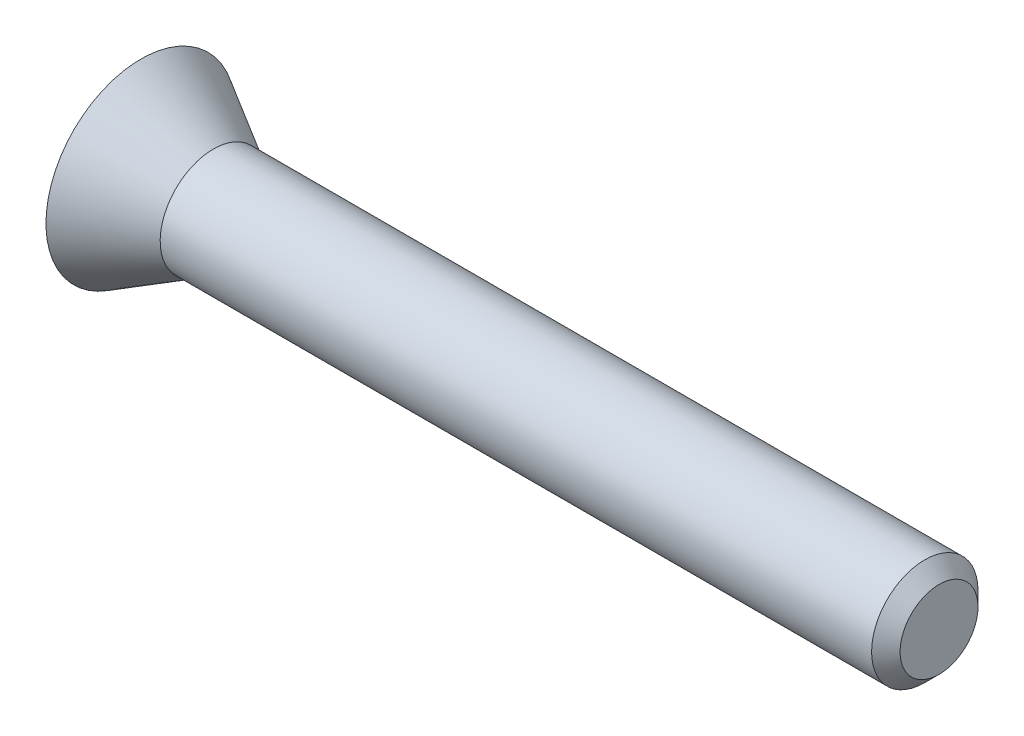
from build123d import *

# Parameters (mm, degrees)
SKETCH1_R           = 1.25
BOSS_EXTRUDE1_DEPTH = 5.25
CUT_EXTRUDE1_DEPTH  = 0.3
CHAMFER1_SIZE       = 0.1875
CUT_EXTRUDE2_DEPTH  = 0.3


with BuildPart() as part:
    # Sketch1 → Boss-Extrude1 (new, symmetric)
    with BuildSketch(Plane(origin=(0, 0, 0), x_dir=(0, 0, -1), z_dir=(1, 0, 0))):
        with Locations(Location((0, 0, 0), (0, 0, 180))):
            Circle(SKETCH1_R)
    extrude(amount=BOSS_EXTRUDE1_DEPTH, both=True)

    # Sketch2 → Cut-Revolve1 (revolve, cut)
    with BuildSketch(Plane.XY, mode=Mode.PRIVATE) as cut_revolve1_sk:
        Polygon((-4.297372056, 0.7), (5.25, 0.7), (5.25, 1.25), (-5.25, 1.25), align=None)
    revolve(cut_revolve1_sk.sketch.rotate(Axis((-5.25, 0, 0), (1, 0, 0)), 180), axis=Axis((-5.25, 0, 0), (1, 0, 0)), mode=Mode.SUBTRACT)

    # Sketch3 → Cut-Extrude1 (cut)
    with BuildSketch(Plane.ZY.offset(5.25)):
        with BuildLine():
            Line((0.125, 0.55), (0.125, -0.825))
            ThreePointArc((0.125, -0.825), (0, -0.95), (-0.125, -0.825))
            Line((-0.125, -0.825), (-0.125, 0.55))
            Line((-0.125, 0.55), (-0.3, 0.55))
            Line((-0.3, 0.55), (0, 1.05))
            Line((0, 1.05), (0.3, 0.55))
            Line((0.3, 0.55), (0.125, 0.55))
        make_face()
    extrude(amount=-CUT_EXTRUDE1_DEPTH, mode=Mode.SUBTRACT)

    # Chamfer1
    chamfer1_edges = [part.edges().sort_by_distance(p)[0] for p in [
        (5.25, 0.7, 0),
    ]]
    chamfer(chamfer1_edges, length=CHAMFER1_SIZE)

    # Sketch4 → Cut-Extrude2 (cut)
    with BuildSketch(Plane.ZY.offset(5.25)):
        with BuildLine():
            Line((0.881276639, -0.6), (0.881276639, -0.429951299))
            Line((0.881276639, -0.429951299), (0.53955586, 0.022767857))
            add(Edge.make_bspline(
                [(0.53955586, 0.022767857), (0.532398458, 0.03285302), (0.518452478, 0.052503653), (0.505830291, 0.079489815), (0.497967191, 0.100647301), (0.494219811, 0.115990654), (0.491546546, 0.130629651), (0.491217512, 0.140248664), (0.491057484, 0.144926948)],
                knots=[0, 0, 0, 0, 1.664252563, 3.24274559, 3.998498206, 4.704056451, 5.369707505, 6, 6, 6, 6], degree=3))
            Line((0.491057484, 0.144926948), (0.491057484, 0.146347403))
            add(Edge.make_bspline(
                [(0.491057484, 0.146347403), (0.491334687, 0.152741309), (0.491865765, 0.164991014), (0.496869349, 0.182251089), (0.505069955, 0.197281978), (0.516815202, 0.209697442), (0.531437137, 0.219517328), (0.548932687, 0.226437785), (0.569072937, 0.230406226), (0.583368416, 0.2309058), (0.590895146, 0.231168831)],
                knots=[0, 0, 0, 0, 1.029992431, 1.973301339, 2.872554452, 3.768620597, 4.704316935, 5.693697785, 6.785705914, 8, 8, 8, 8], degree=3))
            add(Edge.make_bspline(
                [(0.590895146, 0.231168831), (0.598246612, 0.230881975), (0.612530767, 0.230324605), (0.632752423, 0.224147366), (0.650974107, 0.214457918), (0.666682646, 0.200632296), (0.679690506, 0.183273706), (0.690247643, 0.162832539), (0.69741797, 0.138939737), (0.699954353, 0.121836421), (0.701284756, 0.11286526)],
                knots=[0, 0, 0, 0, 0.980828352, 1.905783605, 2.800718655, 3.724477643, 4.680224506, 5.688112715, 6.78735127, 8, 8, 8, 8], degree=3))
            Line((0.701284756, 0.11286526), (0.893654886, 0.112256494))
            add(Edge.make_bspline(
                [(0.893654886, 0.112256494), (0.89270566, 0.124456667), (0.890852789, 0.147082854), (0.884778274, 0.179812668), (0.876927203, 0.210641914), (0.866939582, 0.239564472), (0.854105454, 0.26624545), (0.83968592, 0.291242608), (0.822342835, 0.313782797), (0.803358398, 0.334620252), (0.782213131, 0.352973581), (0.759666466, 0.369163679), (0.735377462, 0.382636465), (0.709715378, 0.393812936), (0.682395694, 0.402295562), (0.653775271, 0.408649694), (0.6235256, 0.41231414), (0.60287735, 0.412759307), (0.592315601, 0.412987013)],
                knots=[0, 0, 0, 0, 1.173229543, 2.290119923, 3.354877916, 4.382703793, 5.372196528, 6.339367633, 7.289741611, 8.236749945, 9.180232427, 10.11040526, 11.033485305, 11.978374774, 12.930610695, 13.916256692, 14.93414813, 16, 16, 16, 16], degree=3))
            add(Edge.make_bspline(
                [(0.592315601, 0.412987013), (0.580942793, 0.412825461), (0.558824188, 0.412511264), (0.526623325, 0.4091196), (0.496325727, 0.404000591), (0.467980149, 0.396511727), (0.441700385, 0.386743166), (0.417407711, 0.374964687), (0.395051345, 0.361075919), (0.374802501, 0.345047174), (0.356583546, 0.327169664), (0.340901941, 0.307261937), (0.327326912, 0.285726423), (0.316715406, 0.262145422), (0.30797916, 0.237073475), (0.302322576, 0.210061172), (0.298510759, 0.18142655), (0.298090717, 0.161715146), (0.297875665, 0.151623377)],
                knots=[0, 0, 0, 0, 1.219700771, 2.37215663, 3.469774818, 4.513610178, 5.512457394, 6.473141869, 7.405450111, 8.330272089, 9.238546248, 10.1372905, 11.043445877, 11.962355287, 12.905558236, 13.886315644, 14.917844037, 16, 16, 16, 16], degree=3))
            add(Edge.make_bspline(
                [(0.297875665, 0.151623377), (0.298134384, 0.139433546), (0.29865228, 0.116657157), (0.303327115, 0.082569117), (0.310860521, 0.048655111), (0.321206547, 0.015078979), (0.334058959, -0.017577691), (0.349484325, -0.048867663), (0.36689383, -0.078804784), (0.380689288, -0.097281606), (0.387567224, -0.106493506)],
                knots=[0, 0, 0, 0, 0.984368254, 1.970475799, 2.971844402, 3.988480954, 5.008197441, 6.005725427, 7.005724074, 8, 8, 8, 8], degree=3))
            Line((0.387567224, -0.106493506), (0.632697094, -0.418181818))
            Line((0.632697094, -0.418181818), (0.292396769, -0.418181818))
            Line((0.292396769, -0.418181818), (0.292396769, -0.6))
            Line((0.292396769, -0.6), (0.881276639, -0.6))
        make_face()
        Polygon((-0.846897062, 0.4), (-0.846897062, 0.274594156), (-0.623682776, -0.6), (-0.420354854, -0.6), (-0.636669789, 0.218181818), (-0.465606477, 0.218181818), (-0.465606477, 0.062337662), (-0.277903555, 0.062337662), (-0.277903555, 0.4), align=None)
    extrude(amount=-CUT_EXTRUDE2_DEPTH, mode=Mode.SUBTRACT)


solid = part.part
